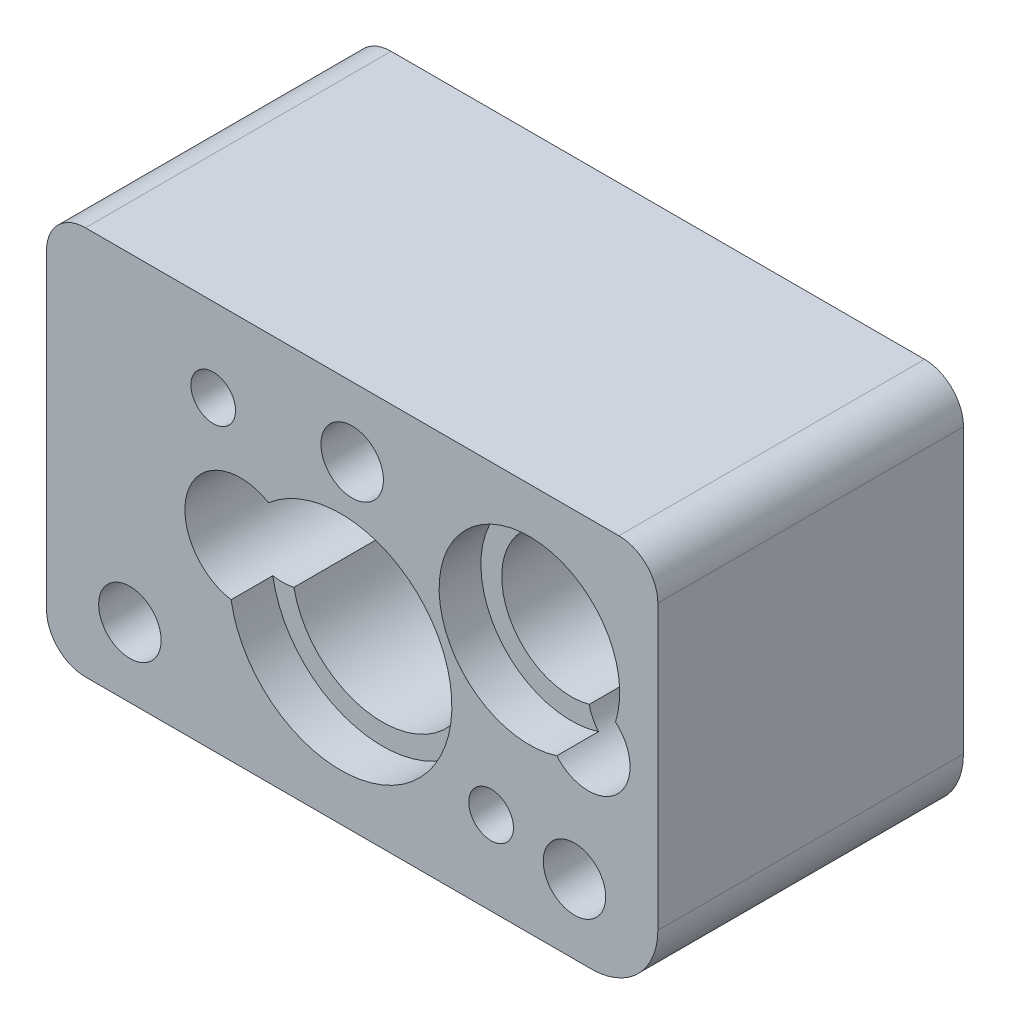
ISO-10303-21;
HEADER;
FILE_DESCRIPTION(('STEP AP214'),'2;1');
FILE_NAME('part.step','',(''),(''),'','','');
FILE_SCHEMA(('AUTOMOTIVE_DESIGN { 1 0 10303 214 1 1 1 1 }'));
ENDSEC;
DATA;
#1=APPLICATION_CONTEXT('core data for automotive mechanical design processes');
#2=APPLICATION_PROTOCOL_DEFINITION('international standard','automotive_design',2000,#1);
#3=PRODUCT_CONTEXT('',#1,'mechanical');
#4=PRODUCT('Part','Part','',(#3));
#5=PRODUCT_RELATED_PRODUCT_CATEGORY('part','',(#4));
#6=PRODUCT_DEFINITION_FORMATION('','',#4);
#7=PRODUCT_DEFINITION_CONTEXT('part definition',#1,'design');
#8=PRODUCT_DEFINITION('design','',#6,#7);
#9=PRODUCT_DEFINITION_SHAPE('','',#8);
#10=(LENGTH_UNIT() NAMED_UNIT(*) SI_UNIT(.MILLI.,.METRE.));
#11=(NAMED_UNIT(*) PLANE_ANGLE_UNIT() SI_UNIT($,.RADIAN.));
#12=(NAMED_UNIT(*) SI_UNIT($,.STERADIAN.) SOLID_ANGLE_UNIT());
#13=UNCERTAINTY_MEASURE_WITH_UNIT(LENGTH_MEASURE(1.E-05),#10,'distance_accuracy_value','');
#14=(GEOMETRIC_REPRESENTATION_CONTEXT(3) GLOBAL_UNCERTAINTY_ASSIGNED_CONTEXT((#13)) GLOBAL_UNIT_ASSIGNED_CONTEXT((#10,
#11,#12)) REPRESENTATION_CONTEXT('',''));
#15=CARTESIAN_POINT('',(0.,0.,0.));
#16=DIRECTION('',(0.,0.,1.));
#17=DIRECTION('',(1.,0.,0.));
#18=AXIS2_PLACEMENT_3D('',#15,#16,#17);
#19=CARTESIAN_POINT('',(-840.26329577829,-45.5554062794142,71.9581999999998));
#20=DIRECTION('',(0.,0.,-1.));
#21=DIRECTION('',(-1.,0.,0.));
#22=AXIS2_PLACEMENT_3D('',#19,#20,#21);
#23=PLANE('',#22);
#24=CARTESIAN_POINT('',(-851.69329577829,-43.6504062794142,71.9581999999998));
#25=DIRECTION('',(0.,0.,1.));
#26=DIRECTION('',(1.,0.,0.));
#27=AXIS2_PLACEMENT_3D('',#24,#25,#26);
#28=CIRCLE('',#27,2.55269999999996);
#29=CARTESIAN_POINT('',(-849.14059577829,-43.6504062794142,71.9581999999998));
#30=VERTEX_POINT('',#29);
#31=EDGE_CURVE('E349',#30,#30,#28,.T.);
#32=ORIENTED_EDGE('',*,*,#31,.F.);
#33=EDGE_LOOP('',(#32));
#34=FACE_BOUND('',#33,.T.);
#35=CARTESIAN_POINT('',(-842.16829577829,-45.2379062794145,71.9581999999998));
#36=DIRECTION('',(0.,0.,-1.));
#37=DIRECTION('',(-1.,0.,0.));
#38=AXIS2_PLACEMENT_3D('',#35,#36,#37);
#39=CIRCLE('',#38,3.56869999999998);
#40=CARTESIAN_POINT('',(-845.73699577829,-45.2379062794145,71.9581999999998));
#41=VERTEX_POINT('',#40);
#42=EDGE_CURVE('E335',#41,#41,#39,.T.);
#43=ORIENTED_EDGE('',*,*,#42,.T.);
#44=EDGE_LOOP('',(#43));
#45=FACE_BOUND('',#44,.T.);
#46=CARTESIAN_POINT('',(-892.96829577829,-45.2379062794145,71.9581999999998));
#47=DIRECTION('',(0.,0.,-1.));
#48=DIRECTION('',(-1.,0.,0.));
#49=AXIS2_PLACEMENT_3D('',#46,#47,#48);
#50=CIRCLE('',#49,3.56869999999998);
#51=CARTESIAN_POINT('',(-896.53699577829,-45.2379062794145,71.9581999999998));
#52=VERTEX_POINT('',#51);
#53=EDGE_CURVE('E312',#52,#52,#50,.T.);
#54=ORIENTED_EDGE('',*,*,#53,.T.);
#55=EDGE_LOOP('',(#54));
#56=FACE_BOUND('',#55,.T.);
#57=CARTESIAN_POINT('',(-867.56829577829,-16.6629062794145,71.9581999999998));
#58=DIRECTION('',(0.,0.,-1.));
#59=DIRECTION('',(-1.,0.,0.));
#60=AXIS2_PLACEMENT_3D('',#57,#58,#59);
#61=CIRCLE('',#60,3.56869999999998);
#62=CARTESIAN_POINT('',(-871.13699577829,-16.6629062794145,71.9581999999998));
#63=VERTEX_POINT('',#62);
#64=EDGE_CURVE('E278',#63,#63,#61,.T.);
#65=ORIENTED_EDGE('',*,*,#64,.T.);
#66=EDGE_LOOP('',(#65));
#67=FACE_BOUND('',#66,.T.);
#68=CARTESIAN_POINT('',(-840.26329577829,-45.5554062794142,71.9581999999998));
#69=DIRECTION('',(0.,0.,-1.));
#70=DIRECTION('',(-1.,0.,0.));
#71=AXIS2_PLACEMENT_3D('',#68,#69,#70);
#72=CIRCLE('',#71,7.61999999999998);
#73=CARTESIAN_POINT('',(-832.64329577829,-45.5554062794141,71.9581999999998));
#74=VERTEX_POINT('',#73);
#75=CARTESIAN_POINT('',(-840.26329577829,-53.1754062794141,71.9581999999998));
#76=VERTEX_POINT('',#75);
#77=EDGE_CURVE('E188',#74,#76,#72,.T.);
#78=ORIENTED_EDGE('',*,*,#77,.F.);
#79=DIRECTION('',(0.,-1.,0.));
#80=VECTOR('',#79,1.);
#81=CARTESIAN_POINT('',(-832.64329577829,-13.1704062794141,71.9581999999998));
#82=LINE('',#81,#80);
#83=CARTESIAN_POINT('',(-832.64329577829,-13.1704062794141,71.9581999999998));
#84=VERTEX_POINT('',#83);
#85=EDGE_CURVE('E393',#84,#74,#82,.T.);
#86=ORIENTED_EDGE('',*,*,#85,.F.);
#87=CARTESIAN_POINT('',(-837.08829577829,-13.1704062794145,71.9581999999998));
#88=DIRECTION('',(0.,0.,-1.));
#89=DIRECTION('',(-1.,0.,0.));
#90=AXIS2_PLACEMENT_3D('',#87,#88,#89);
#91=CIRCLE('',#90,4.44500000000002);
#92=CARTESIAN_POINT('',(-837.08829577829,-8.7254062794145,71.9581999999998));
#93=VERTEX_POINT('',#92);
#94=EDGE_CURVE('E387',#93,#84,#91,.T.);
#95=ORIENTED_EDGE('',*,*,#94,.F.);
#96=DIRECTION('',(1.,0.,0.));
#97=VECTOR('',#96,1.);
#98=CARTESIAN_POINT('',(-837.08829577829,-8.72540627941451,71.9581999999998));
#99=LINE('',#98,#97);
#100=CARTESIAN_POINT('',(-898.04829577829,-8.72540627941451,71.9581999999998));
#101=VERTEX_POINT('',#100);
#102=EDGE_CURVE('E394',#101,#93,#99,.T.);
#103=ORIENTED_EDGE('',*,*,#102,.F.);
#104=CARTESIAN_POINT('',(-898.04829577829,-13.1704062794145,71.9581999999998));
#105=DIRECTION('',(0.,0.,-1.));
#106=DIRECTION('',(1.,0.,0.));
#107=AXIS2_PLACEMENT_3D('',#104,#105,#106);
#108=CIRCLE('',#107,4.44500000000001);
#109=CARTESIAN_POINT('',(-902.49329577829,-13.1704062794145,71.9581999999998));
#110=VERTEX_POINT('',#109);
#111=EDGE_CURVE('E862',#110,#101,#108,.T.);
#112=ORIENTED_EDGE('',*,*,#111,.F.);
#113=DIRECTION('',(0.,1.,0.));
#114=VECTOR('',#113,1.);
#115=CARTESIAN_POINT('',(-902.49329577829,-13.1704062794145,71.9581999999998));
#116=LINE('',#115,#114);
#117=CARTESIAN_POINT('',(-902.49329577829,-48.7304062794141,71.9581999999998));
#118=VERTEX_POINT('',#117);
#119=EDGE_CURVE('E844',#118,#110,#116,.T.);
#120=ORIENTED_EDGE('',*,*,#119,.F.);
#121=CARTESIAN_POINT('',(-898.04829577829,-48.7304062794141,71.9581999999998));
#122=DIRECTION('',(0.,0.,-1.));
#123=DIRECTION('',(-1.,0.,0.));
#124=AXIS2_PLACEMENT_3D('',#121,#122,#123);
#125=CIRCLE('',#124,4.44500000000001);
#126=CARTESIAN_POINT('',(-898.04829577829,-53.1754062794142,71.9581999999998));
#127=VERTEX_POINT('',#126);
#128=EDGE_CURVE('E839',#127,#118,#125,.T.);
#129=ORIENTED_EDGE('',*,*,#128,.F.);
#130=DIRECTION('',(-1.,0.,0.));
#131=VECTOR('',#130,1.);
#132=CARTESIAN_POINT('',(-840.26329577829,-53.1754062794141,71.9581999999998));
#133=LINE('',#132,#131);
#134=EDGE_CURVE('E195',#76,#127,#133,.T.);
#135=ORIENTED_EDGE('',*,*,#134,.F.);
#136=EDGE_LOOP('',(#78,#86,#95,#103,#112,#120,#129,#135));
#137=FACE_BOUND('',#136,.T.);
#138=CARTESIAN_POINT('',(-840.580795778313,-30.9504062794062,71.9581999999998));
#139=DIRECTION('',(0.,0.,1.));
#140=DIRECTION('',(1.,0.,0.));
#141=AXIS2_PLACEMENT_3D('',#138,#139,#140);
#142=CIRCLE('',#141,4.7625);
#143=CARTESIAN_POINT('',(-844.195798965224,-34.0509156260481,71.9581999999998));
#144=VERTEX_POINT('',#143);
#145=CARTESIAN_POINT('',(-837.48028643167,-27.3354030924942,71.9581999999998));
#146=VERTEX_POINT('',#145);
#147=EDGE_CURVE('E198',#144,#146,#142,.T.);
#148=ORIENTED_EDGE('',*,*,#147,.F.);
#149=CARTESIAN_POINT('',(-847.315987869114,-24.2152141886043,71.9581999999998));
#150=DIRECTION('',(0.,0.,1.));
#151=DIRECTION('',(1.,0.,0.));
#152=AXIS2_PLACEMENT_3D('',#149,#150,#151);
#153=CIRCLE('',#152,10.31875);
#154=EDGE_CURVE('E481',#146,#144,#153,.T.);
#155=ORIENTED_EDGE('',*,*,#154,.F.);
#156=EDGE_LOOP('',(#148,#155));
#157=FACE_BOUND('',#156,.T.);
#158=CARTESIAN_POINT('',(-868.875063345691,-35.1203158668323,71.9581999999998));
#159=DIRECTION('',(0.,0.,1.));
#160=DIRECTION('',(1.,0.,0.));
#161=AXIS2_PLACEMENT_3D('',#158,#159,#160);
#162=CIRCLE('',#161,12.7);
#163=CARTESIAN_POINT('',(-881.402035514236,-37.2095665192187,71.9581999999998));
#164=VERTEX_POINT('',#163);
#165=CARTESIAN_POINT('',(-877.128336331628,-25.4676745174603,71.9581999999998));
#166=VERTEX_POINT('',#165);
#167=EDGE_CURVE('E167',#164,#166,#162,.T.);
#168=ORIENTED_EDGE('',*,*,#167,.F.);
#169=CARTESIAN_POINT('',(-880.331795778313,-30.9504062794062,71.9581999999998));
#170=DIRECTION('',(0.,0.,1.));
#171=DIRECTION('',(1.,0.,0.));
#172=AXIS2_PLACEMENT_3D('',#169,#170,#171);
#173=CIRCLE('',#172,6.34999999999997);
#174=EDGE_CURVE('E183',#166,#164,#173,.T.);
#175=ORIENTED_EDGE('',*,*,#174,.F.);
#176=EDGE_LOOP('',(#168,#175));
#177=FACE_BOUND('',#176,.T.);
#178=CARTESIAN_POINT('',(-883.44329577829,-18.2504062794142,71.9581999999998));
#179=DIRECTION('',(0.,0.,1.));
#180=DIRECTION('',(1.,0.,0.));
#181=AXIS2_PLACEMENT_3D('',#178,#179,#180);
#182=CIRCLE('',#181,2.55269999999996);
#183=CARTESIAN_POINT('',(-880.89059577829,-18.2504062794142,71.9581999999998));
#184=VERTEX_POINT('',#183);
#185=EDGE_CURVE('E348',#184,#184,#182,.T.);
#186=ORIENTED_EDGE('',*,*,#185,.F.);
#187=EDGE_LOOP('',(#186));
#188=FACE_BOUND('',#187,.T.);
#189=ADVANCED_FACE('F54',(#34,#45,#56,#67,#137,#157,#177,#188),#23,.F.);
#190=CARTESIAN_POINT('',(-840.26329577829,-45.5554062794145,37.0331999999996));
#191=DIRECTION('',(0.,0.,-1.));
#192=DIRECTION('',(-1.,0.,0.));
#193=AXIS2_PLACEMENT_3D('',#190,#191,#192);
#194=PLANE('',#193);
#195=CARTESIAN_POINT('',(-851.69329577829,-43.6504062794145,37.0331999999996));
#196=DIRECTION('',(0.,0.,1.));
#197=DIRECTION('',(1.,0.,0.));
#198=AXIS2_PLACEMENT_3D('',#195,#196,#197);
#199=CIRCLE('',#198,2.55269999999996);
#200=CARTESIAN_POINT('',(-849.14059577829,-43.6504062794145,37.0331999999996));
#201=VERTEX_POINT('',#200);
#202=EDGE_CURVE('E772',#201,#201,#199,.T.);
#203=ORIENTED_EDGE('',*,*,#202,.T.);
#204=EDGE_LOOP('',(#203));
#205=FACE_BOUND('',#204,.T.);
#206=CARTESIAN_POINT('',(-883.44329577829,-18.2504062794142,37.0331999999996));
#207=DIRECTION('',(0.,0.,1.));
#208=DIRECTION('',(1.,0.,0.));
#209=AXIS2_PLACEMENT_3D('',#206,#207,#208);
#210=CIRCLE('',#209,2.55269999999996);
#211=CARTESIAN_POINT('',(-880.89059577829,-18.2504062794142,37.0331999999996));
#212=VERTEX_POINT('',#211);
#213=EDGE_CURVE('E343',#212,#212,#210,.T.);
#214=ORIENTED_EDGE('',*,*,#213,.T.);
#215=EDGE_LOOP('',(#214));
#216=FACE_BOUND('',#215,.T.);
#217=CARTESIAN_POINT('',(-842.16829577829,-45.2379062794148,37.0331999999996));
#218=DIRECTION('',(0.,0.,-1.));
#219=DIRECTION('',(-1.,0.,0.));
#220=AXIS2_PLACEMENT_3D('',#217,#218,#219);
#221=CIRCLE('',#220,5.35940000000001);
#222=CARTESIAN_POINT('',(-847.52769577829,-45.2379062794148,37.0331999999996));
#223=VERTEX_POINT('',#222);
#224=EDGE_CURVE('E317',#223,#223,#221,.T.);
#225=ORIENTED_EDGE('',*,*,#224,.F.);
#226=EDGE_LOOP('',(#225));
#227=FACE_BOUND('',#226,.T.);
#228=CARTESIAN_POINT('',(-892.96829577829,-45.2379062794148,37.0331999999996));
#229=DIRECTION('',(0.,0.,-1.));
#230=DIRECTION('',(-1.,0.,0.));
#231=AXIS2_PLACEMENT_3D('',#228,#229,#230);
#232=CIRCLE('',#231,5.35940000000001);
#233=CARTESIAN_POINT('',(-898.32769577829,-45.2379062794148,37.0331999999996));
#234=VERTEX_POINT('',#233);
#235=EDGE_CURVE('E285',#234,#234,#232,.T.);
#236=ORIENTED_EDGE('',*,*,#235,.F.);
#237=EDGE_LOOP('',(#236));
#238=FACE_BOUND('',#237,.T.);
#239=CARTESIAN_POINT('',(-867.56829577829,-16.6629062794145,37.0331999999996));
#240=DIRECTION('',(0.,0.,-1.));
#241=DIRECTION('',(-1.,0.,0.));
#242=AXIS2_PLACEMENT_3D('',#239,#240,#241);
#243=CIRCLE('',#242,5.35940000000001);
#244=CARTESIAN_POINT('',(-872.92769577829,-16.6629062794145,37.0331999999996));
#245=VERTEX_POINT('',#244);
#246=EDGE_CURVE('E263',#245,#245,#243,.T.);
#247=ORIENTED_EDGE('',*,*,#246,.F.);
#248=EDGE_LOOP('',(#247));
#249=FACE_BOUND('',#248,.T.);
#250=CARTESIAN_POINT('',(-847.315987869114,-24.2152141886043,37.0331999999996));
#251=DIRECTION('',(0.,0.,1.));
#252=DIRECTION('',(1.,0.,0.));
#253=AXIS2_PLACEMENT_3D('',#250,#251,#252);
#254=CIRCLE('',#253,7.93750000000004);
#255=CARTESIAN_POINT('',(-839.651595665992,-26.2794327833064,37.0331999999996));
#256=VERTEX_POINT('',#255);
#257=CARTESIAN_POINT('',(-845.251769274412,-31.8796063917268,37.0331999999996));
#258=VERTEX_POINT('',#257);
#259=EDGE_CURVE('E79',#256,#258,#254,.T.);
#260=ORIENTED_EDGE('',*,*,#259,.T.);
#261=CARTESIAN_POINT('',(-840.580795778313,-30.9504062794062,37.0331999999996));
#262=DIRECTION('',(0.,0.,1.));
#263=DIRECTION('',(1.,0.,0.));
#264=AXIS2_PLACEMENT_3D('',#261,#262,#263);
#265=CIRCLE('',#264,4.7625);
#266=EDGE_CURVE('E492',#258,#256,#265,.T.);
#267=ORIENTED_EDGE('',*,*,#266,.T.);
#268=EDGE_LOOP('',(#260,#267));
#269=FACE_BOUND('',#268,.T.);
#270=CARTESIAN_POINT('',(-840.26329577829,-45.5554062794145,37.0331999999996));
#271=DIRECTION('',(0.,0.,-1.));
#272=DIRECTION('',(-1.,0.,0.));
#273=AXIS2_PLACEMENT_3D('',#270,#271,#272);
#274=CIRCLE('',#273,7.61999999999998);
#275=CARTESIAN_POINT('',(-832.64329577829,-45.5554062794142,37.0331999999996));
#276=VERTEX_POINT('',#275);
#277=CARTESIAN_POINT('',(-840.26329577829,-53.1754062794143,37.0332));
#278=VERTEX_POINT('',#277);
#279=EDGE_CURVE('E398',#276,#278,#274,.T.);
#280=ORIENTED_EDGE('',*,*,#279,.T.);
#281=DIRECTION('',(-1.,0.,0.));
#282=VECTOR('',#281,1.);
#283=CARTESIAN_POINT('',(-840.26329577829,-53.1754062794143,37.0332));
#284=LINE('',#283,#282);
#285=CARTESIAN_POINT('',(-898.04829577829,-53.1754062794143,37.0332));
#286=VERTEX_POINT('',#285);
#287=EDGE_CURVE('E402',#278,#286,#284,.T.);
#288=ORIENTED_EDGE('',*,*,#287,.T.);
#289=CARTESIAN_POINT('',(-898.04829577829,-48.7304062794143,37.0331999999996));
#290=DIRECTION('',(0.,0.,-1.));
#291=DIRECTION('',(-1.,0.,0.));
#292=AXIS2_PLACEMENT_3D('',#289,#290,#291);
#293=CIRCLE('',#292,4.44500000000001);
#294=CARTESIAN_POINT('',(-902.49329577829,-48.7304062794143,37.0331999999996));
#295=VERTEX_POINT('',#294);
#296=EDGE_CURVE('E405',#286,#295,#293,.T.);
#297=ORIENTED_EDGE('',*,*,#296,.T.);
#298=DIRECTION('',(0.,1.,0.));
#299=VECTOR('',#298,1.);
#300=CARTESIAN_POINT('',(-902.49329577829,-13.1704062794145,37.0331999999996));
#301=LINE('',#300,#299);
#302=CARTESIAN_POINT('',(-902.49329577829,-13.1704062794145,37.0331999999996));
#303=VERTEX_POINT('',#302);
#304=EDGE_CURVE('E408',#295,#303,#301,.T.);
#305=ORIENTED_EDGE('',*,*,#304,.T.);
#306=CARTESIAN_POINT('',(-898.04829577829,-13.1704062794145,37.0331999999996));
#307=DIRECTION('',(0.,0.,-1.));
#308=DIRECTION('',(1.,0.,0.));
#309=AXIS2_PLACEMENT_3D('',#306,#307,#308);
#310=CIRCLE('',#309,4.44500000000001);
#311=CARTESIAN_POINT('',(-898.04829577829,-8.72540627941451,37.0331999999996));
#312=VERTEX_POINT('',#311);
#313=EDGE_CURVE('E411',#303,#312,#310,.T.);
#314=ORIENTED_EDGE('',*,*,#313,.T.);
#315=DIRECTION('',(1.,0.,0.));
#316=VECTOR('',#315,1.);
#317=CARTESIAN_POINT('',(-837.08829577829,-8.72540627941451,37.0331999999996));
#318=LINE('',#317,#316);
#319=CARTESIAN_POINT('',(-837.08829577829,-8.7254062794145,37.0331999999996));
#320=VERTEX_POINT('',#319);
#321=EDGE_CURVE('E414',#312,#320,#318,.T.);
#322=ORIENTED_EDGE('',*,*,#321,.T.);
#323=CARTESIAN_POINT('',(-837.08829577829,-13.1704062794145,37.0331999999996));
#324=DIRECTION('',(0.,0.,-1.));
#325=DIRECTION('',(-1.,0.,0.));
#326=AXIS2_PLACEMENT_3D('',#323,#324,#325);
#327=CIRCLE('',#326,4.44500000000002);
#328=CARTESIAN_POINT('',(-832.64329577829,-13.1704062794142,37.0331999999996));
#329=VERTEX_POINT('',#328);
#330=EDGE_CURVE('E416',#320,#329,#327,.T.);
#331=ORIENTED_EDGE('',*,*,#330,.T.);
#332=DIRECTION('',(0.,-1.,0.));
#333=VECTOR('',#332,1.);
#334=CARTESIAN_POINT('',(-832.64329577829,-13.1704062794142,37.0331999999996));
#335=LINE('',#334,#333);
#336=EDGE_CURVE('E370',#329,#276,#335,.T.);
#337=ORIENTED_EDGE('',*,*,#336,.T.);
#338=EDGE_LOOP('',(#280,#288,#297,#305,#314,#322,#331,#337));
#339=FACE_BOUND('',#338,.T.);
#340=CARTESIAN_POINT('',(-880.331795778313,-30.9504062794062,37.0331999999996));
#341=DIRECTION('',(0.,0.,1.));
#342=DIRECTION('',(1.,0.,0.));
#343=AXIS2_PLACEMENT_3D('',#340,#341,#342);
#344=CIRCLE('',#343,6.34999999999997);
#345=CARTESIAN_POINT('',(-875.31487430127,-27.0577209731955,37.0331999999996));
#346=VERTEX_POINT('',#345);
#347=CARTESIAN_POINT('',(-878.990780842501,-37.157191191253,37.0331999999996));
#348=VERTEX_POINT('',#347);
#349=EDGE_CURVE('E189',#346,#348,#344,.T.);
#350=ORIENTED_EDGE('',*,*,#349,.T.);
#351=CARTESIAN_POINT('',(-868.875063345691,-35.1203158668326,37.0331999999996));
#352=DIRECTION('',(0.,0.,1.));
#353=DIRECTION('',(1.,0.,0.));
#354=AXIS2_PLACEMENT_3D('',#351,#352,#353);
#355=CIRCLE('',#354,10.31875);
#356=EDGE_CURVE('E240',#348,#346,#355,.T.);
#357=ORIENTED_EDGE('',*,*,#356,.T.);
#358=EDGE_LOOP('',(#350,#357));
#359=FACE_BOUND('',#358,.T.);
#360=ADVANCED_FACE('F239',(#205,#216,#227,#238,#249,#269,#339,#359),#194,.T.);
#361=CARTESIAN_POINT('',(-840.26329577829,-45.5554062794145,37.0331999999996));
#362=DIRECTION('',(0.,0.,1.));
#363=DIRECTION('',(1.,0.,0.));
#364=AXIS2_PLACEMENT_3D('',#361,#362,#363);
#365=CYLINDRICAL_SURFACE('',#364,7.61999999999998);
#366=DIRECTION('',(0.,0.,1.));
#367=VECTOR('',#366,1.);
#368=CARTESIAN_POINT('',(-832.64329577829,-45.5554062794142,37.0331999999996));
#369=LINE('',#368,#367);
#370=EDGE_CURVE('E364',#276,#74,#369,.T.);
#371=ORIENTED_EDGE('',*,*,#370,.T.);
#372=ORIENTED_EDGE('',*,*,#77,.T.);
#373=DIRECTION('',(0.,0.,1.));
#374=VECTOR('',#373,1.);
#375=CARTESIAN_POINT('',(-840.26329577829,-53.1754062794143,37.0332));
#376=LINE('',#375,#374);
#377=EDGE_CURVE('E433',#278,#76,#376,.T.);
#378=ORIENTED_EDGE('',*,*,#377,.F.);
#379=ORIENTED_EDGE('',*,*,#279,.F.);
#380=EDGE_LOOP('',(#371,#372,#378,#379));
#381=FACE_BOUND('',#380,.T.);
#382=ADVANCED_FACE('F56',(#381),#365,.T.);
#383=CARTESIAN_POINT('',(-840.26329577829,-53.1754062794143,37.0332));
#384=DIRECTION('',(0.,1.,0.));
#385=DIRECTION('',(-1.,0.,0.));
#386=AXIS2_PLACEMENT_3D('',#383,#384,#385);
#387=PLANE('',#386);
#388=ORIENTED_EDGE('',*,*,#377,.T.);
#389=ORIENTED_EDGE('',*,*,#134,.T.);
#390=DIRECTION('',(0.,0.,1.));
#391=VECTOR('',#390,1.);
#392=CARTESIAN_POINT('',(-898.04829577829,-53.1754062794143,37.0332));
#393=LINE('',#392,#391);
#394=EDGE_CURVE('E439',#286,#127,#393,.T.);
#395=ORIENTED_EDGE('',*,*,#394,.F.);
#396=ORIENTED_EDGE('',*,*,#287,.F.);
#397=EDGE_LOOP('',(#388,#389,#395,#396));
#398=FACE_BOUND('',#397,.T.);
#399=ADVANCED_FACE('F555',(#398),#387,.F.);
#400=CARTESIAN_POINT('',(-898.04829577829,-48.7304062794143,37.0331999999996));
#401=DIRECTION('',(0.,0.,1.));
#402=DIRECTION('',(1.,0.,0.));
#403=AXIS2_PLACEMENT_3D('',#400,#401,#402);
#404=CYLINDRICAL_SURFACE('',#403,4.44500000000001);
#405=ORIENTED_EDGE('',*,*,#394,.T.);
#406=ORIENTED_EDGE('',*,*,#128,.T.);
#407=DIRECTION('',(0.,0.,1.));
#408=VECTOR('',#407,1.);
#409=CARTESIAN_POINT('',(-902.49329577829,-48.7304062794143,37.0331999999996));
#410=LINE('',#409,#408);
#411=EDGE_CURVE('E446',#295,#118,#410,.T.);
#412=ORIENTED_EDGE('',*,*,#411,.F.);
#413=ORIENTED_EDGE('',*,*,#296,.F.);
#414=EDGE_LOOP('',(#405,#406,#412,#413));
#415=FACE_BOUND('',#414,.T.);
#416=ADVANCED_FACE('F552',(#415),#404,.T.);
#417=CARTESIAN_POINT('',(-902.49329577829,-13.1704062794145,37.0331999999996));
#418=DIRECTION('',(1.,0.,0.));
#419=DIRECTION('',(0.,0.,-1.));
#420=AXIS2_PLACEMENT_3D('',#417,#418,#419);
#421=PLANE('',#420);
#422=ORIENTED_EDGE('',*,*,#411,.T.);
#423=ORIENTED_EDGE('',*,*,#119,.T.);
#424=DIRECTION('',(0.,0.,1.));
#425=VECTOR('',#424,1.);
#426=CARTESIAN_POINT('',(-902.49329577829,-13.1704062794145,37.0331999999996));
#427=LINE('',#426,#425);
#428=EDGE_CURVE('E849',#303,#110,#427,.T.);
#429=ORIENTED_EDGE('',*,*,#428,.F.);
#430=ORIENTED_EDGE('',*,*,#304,.F.);
#431=EDGE_LOOP('',(#422,#423,#429,#430));
#432=FACE_BOUND('',#431,.T.);
#433=ADVANCED_FACE('F548',(#432),#421,.F.);
#434=CARTESIAN_POINT('',(-898.04829577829,-13.1704062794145,37.0331999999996));
#435=DIRECTION('',(0.,0.,1.));
#436=DIRECTION('',(1.,0.,0.));
#437=AXIS2_PLACEMENT_3D('',#434,#435,#436);
#438=CYLINDRICAL_SURFACE('',#437,4.44500000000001);
#439=ORIENTED_EDGE('',*,*,#428,.T.);
#440=ORIENTED_EDGE('',*,*,#111,.T.);
#441=DIRECTION('',(0.,0.,1.));
#442=VECTOR('',#441,1.);
#443=CARTESIAN_POINT('',(-898.04829577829,-8.72540627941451,37.0331999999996));
#444=LINE('',#443,#442);
#445=EDGE_CURVE('E378',#312,#101,#444,.T.);
#446=ORIENTED_EDGE('',*,*,#445,.F.);
#447=ORIENTED_EDGE('',*,*,#313,.F.);
#448=EDGE_LOOP('',(#439,#440,#446,#447));
#449=FACE_BOUND('',#448,.T.);
#450=ADVANCED_FACE('F544',(#449),#438,.T.);
#451=CARTESIAN_POINT('',(-837.08829577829,-8.72540627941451,37.0331999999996));
#452=DIRECTION('',(0.,-1.,0.));
#453=DIRECTION('',(0.,0.,-1.));
#454=AXIS2_PLACEMENT_3D('',#451,#452,#453);
#455=PLANE('',#454);
#456=ORIENTED_EDGE('',*,*,#445,.T.);
#457=ORIENTED_EDGE('',*,*,#102,.T.);
#458=DIRECTION('',(0.,0.,1.));
#459=VECTOR('',#458,1.);
#460=CARTESIAN_POINT('',(-837.08829577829,-8.7254062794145,37.0331999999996));
#461=LINE('',#460,#459);
#462=EDGE_CURVE('E374',#320,#93,#461,.T.);
#463=ORIENTED_EDGE('',*,*,#462,.F.);
#464=ORIENTED_EDGE('',*,*,#321,.F.);
#465=EDGE_LOOP('',(#456,#457,#463,#464));
#466=FACE_BOUND('',#465,.T.);
#467=ADVANCED_FACE('F540',(#466),#455,.F.);
#468=CARTESIAN_POINT('',(-837.08829577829,-13.1704062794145,37.0331999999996));
#469=DIRECTION('',(0.,0.,1.));
#470=DIRECTION('',(1.,0.,0.));
#471=AXIS2_PLACEMENT_3D('',#468,#469,#470);
#472=CYLINDRICAL_SURFACE('',#471,4.44500000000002);
#473=ORIENTED_EDGE('',*,*,#462,.T.);
#474=ORIENTED_EDGE('',*,*,#94,.T.);
#475=DIRECTION('',(0.,0.,1.));
#476=VECTOR('',#475,1.);
#477=CARTESIAN_POINT('',(-832.64329577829,-13.1704062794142,37.0331999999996));
#478=LINE('',#477,#476);
#479=EDGE_CURVE('E369',#329,#84,#478,.T.);
#480=ORIENTED_EDGE('',*,*,#479,.F.);
#481=ORIENTED_EDGE('',*,*,#330,.F.);
#482=EDGE_LOOP('',(#473,#474,#480,#481));
#483=FACE_BOUND('',#482,.T.);
#484=ADVANCED_FACE('F537',(#483),#472,.T.);
#485=CARTESIAN_POINT('',(-832.64329577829,-13.1704062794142,37.0331999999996));
#486=DIRECTION('',(-1.,0.,0.));
#487=DIRECTION('',(0.,0.,1.));
#488=AXIS2_PLACEMENT_3D('',#485,#486,#487);
#489=PLANE('',#488);
#490=ORIENTED_EDGE('',*,*,#479,.T.);
#491=ORIENTED_EDGE('',*,*,#85,.T.);
#492=ORIENTED_EDGE('',*,*,#370,.F.);
#493=ORIENTED_EDGE('',*,*,#336,.F.);
#494=EDGE_LOOP('',(#490,#491,#492,#493));
#495=FACE_BOUND('',#494,.T.);
#496=ADVANCED_FACE('F429',(#495),#489,.F.);
#497=CARTESIAN_POINT('',(-880.331795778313,-30.9504062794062,71.9581999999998));
#498=DIRECTION('',(0.,0.,1.));
#499=DIRECTION('',(1.,0.,0.));
#500=AXIS2_PLACEMENT_3D('',#497,#498,#499);
#501=CYLINDRICAL_SURFACE('',#500,6.34999999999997);
#502=ORIENTED_EDGE('',*,*,#349,.F.);
#503=DIRECTION('',(0.,0.,1.));
#504=VECTOR('',#503,1.);
#505=CARTESIAN_POINT('',(-875.31487430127,-27.0577209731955,52.1144499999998));
#506=LINE('',#505,#504);
#507=CARTESIAN_POINT('',(-875.31487430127,-27.0577209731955,67.1956999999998));
#508=VERTEX_POINT('',#507);
#509=EDGE_CURVE('E12',#346,#508,#506,.T.);
#510=ORIENTED_EDGE('',*,*,#509,.T.);
#511=CARTESIAN_POINT('',(-880.331795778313,-30.9504062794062,67.1956999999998));
#512=DIRECTION('',(0.,0.,-1.));
#513=DIRECTION('',(-1.,0.,0.));
#514=AXIS2_PLACEMENT_3D('',#511,#512,#513);
#515=CIRCLE('',#514,6.34999999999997);
#516=CARTESIAN_POINT('',(-877.128336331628,-25.4676745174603,67.1956999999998));
#517=VERTEX_POINT('',#516);
#518=EDGE_CURVE('E64',#508,#517,#515,.F.);
#519=ORIENTED_EDGE('',*,*,#518,.T.);
#520=DIRECTION('',(0.,0.,1.));
#521=VECTOR('',#520,1.);
#522=CARTESIAN_POINT('',(-877.128336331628,-25.4676745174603,69.5769499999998));
#523=LINE('',#522,#521);
#524=EDGE_CURVE('E170',#517,#166,#523,.T.);
#525=ORIENTED_EDGE('',*,*,#524,.T.);
#526=ORIENTED_EDGE('',*,*,#174,.T.);
#527=DIRECTION('',(0.,0.,1.));
#528=VECTOR('',#527,1.);
#529=CARTESIAN_POINT('',(-881.402035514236,-37.2095665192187,69.5769499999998));
#530=LINE('',#529,#528);
#531=CARTESIAN_POINT('',(-881.402035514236,-37.2095665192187,67.1956999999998));
#532=VERTEX_POINT('',#531);
#533=EDGE_CURVE('E71',#164,#532,#530,.F.);
#534=ORIENTED_EDGE('',*,*,#533,.T.);
#535=CARTESIAN_POINT('',(-878.990780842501,-37.1571911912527,67.1956999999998));
#536=VERTEX_POINT('',#535);
#537=EDGE_CURVE('E176',#532,#536,#515,.F.);
#538=ORIENTED_EDGE('',*,*,#537,.T.);
#539=DIRECTION('',(0.,0.,1.));
#540=VECTOR('',#539,1.);
#541=CARTESIAN_POINT('',(-878.990780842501,-37.1571911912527,52.1144499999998));
#542=LINE('',#541,#540);
#543=EDGE_CURVE('E227',#536,#348,#542,.F.);
#544=ORIENTED_EDGE('',*,*,#543,.T.);
#545=EDGE_LOOP('',(#502,#510,#519,#525,#526,#534,#538,#544));
#546=FACE_BOUND('',#545,.T.);
#547=ADVANCED_FACE('F182',(#546),#501,.F.);
#548=CARTESIAN_POINT('',(-840.580795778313,-30.9504062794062,71.9581999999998));
#549=DIRECTION('',(0.,0.,1.));
#550=DIRECTION('',(1.,0.,0.));
#551=AXIS2_PLACEMENT_3D('',#548,#549,#550);
#552=CYLINDRICAL_SURFACE('',#551,4.7625);
#553=CARTESIAN_POINT('',(-840.580795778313,-30.9504062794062,67.1829999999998));
#554=DIRECTION('',(0.,0.,-1.));
#555=DIRECTION('',(-1.,0.,0.));
#556=AXIS2_PLACEMENT_3D('',#553,#554,#555);
#557=CIRCLE('',#556,4.7625);
#558=CARTESIAN_POINT('',(-845.251769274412,-31.8796063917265,67.1829999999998));
#559=VERTEX_POINT('',#558);
#560=CARTESIAN_POINT('',(-844.195798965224,-34.0509156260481,67.1829999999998));
#561=VERTEX_POINT('',#560);
#562=EDGE_CURVE('E221',#559,#561,#557,.F.);
#563=ORIENTED_EDGE('',*,*,#562,.T.);
#564=DIRECTION('',(0.,0.,1.));
#565=VECTOR('',#564,1.);
#566=CARTESIAN_POINT('',(-844.195798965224,-34.0509156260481,69.5705999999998));
#567=LINE('',#566,#565);
#568=EDGE_CURVE('E177',#561,#144,#567,.T.);
#569=ORIENTED_EDGE('',*,*,#568,.T.);
#570=ORIENTED_EDGE('',*,*,#147,.T.);
#571=DIRECTION('',(0.,0.,1.));
#572=VECTOR('',#571,1.);
#573=CARTESIAN_POINT('',(-837.48028643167,-27.3354030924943,69.5705999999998));
#574=LINE('',#573,#572);
#575=CARTESIAN_POINT('',(-837.48028643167,-27.3354030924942,67.1829999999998));
#576=VERTEX_POINT('',#575);
#577=EDGE_CURVE('E453',#146,#576,#574,.F.);
#578=ORIENTED_EDGE('',*,*,#577,.T.);
#579=CARTESIAN_POINT('',(-839.651595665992,-26.2794327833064,67.1829999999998));
#580=VERTEX_POINT('',#579);
#581=EDGE_CURVE('E444',#576,#580,#557,.F.);
#582=ORIENTED_EDGE('',*,*,#581,.T.);
#583=DIRECTION('',(0.,0.,1.));
#584=VECTOR('',#583,1.);
#585=CARTESIAN_POINT('',(-839.651595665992,-26.2794327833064,52.1080999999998));
#586=LINE('',#585,#584);
#587=EDGE_CURVE('E438',#580,#256,#586,.F.);
#588=ORIENTED_EDGE('',*,*,#587,.T.);
#589=ORIENTED_EDGE('',*,*,#266,.F.);
#590=DIRECTION('',(0.,0.,1.));
#591=VECTOR('',#590,1.);
#592=CARTESIAN_POINT('',(-845.251769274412,-31.8796063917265,52.1080999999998));
#593=LINE('',#592,#591);
#594=EDGE_CURVE('E222',#258,#559,#593,.T.);
#595=ORIENTED_EDGE('',*,*,#594,.T.);
#596=EDGE_LOOP('',(#563,#569,#570,#578,#582,#588,#589,#595));
#597=FACE_BOUND('',#596,.T.);
#598=ADVANCED_FACE('F466',(#597),#552,.F.);
#599=CARTESIAN_POINT('',(-839.378487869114,-24.215214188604,67.1829999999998));
#600=DIRECTION('',(0.,0.,-1.));
#601=DIRECTION('',(-1.,0.,0.));
#602=AXIS2_PLACEMENT_3D('',#599,#600,#601);
#603=PLANE('',#602);
#604=CARTESIAN_POINT('',(-847.315987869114,-24.2152141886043,67.1829999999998));
#605=DIRECTION('',(0.,0.,1.));
#606=DIRECTION('',(1.,0.,0.));
#607=AXIS2_PLACEMENT_3D('',#604,#605,#606);
#608=CIRCLE('',#607,7.93750000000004);
#609=EDGE_CURVE('E473',#580,#559,#608,.T.);
#610=ORIENTED_EDGE('',*,*,#609,.F.);
#611=ORIENTED_EDGE('',*,*,#581,.F.);
#612=CARTESIAN_POINT('',(-847.315987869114,-24.2152141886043,67.1829999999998));
#613=DIRECTION('',(0.,0.,1.));
#614=DIRECTION('',(1.,0.,0.));
#615=AXIS2_PLACEMENT_3D('',#612,#613,#614);
#616=CIRCLE('',#615,10.31875);
#617=EDGE_CURVE('E475',#576,#561,#616,.T.);
#618=ORIENTED_EDGE('',*,*,#617,.T.);
#619=ORIENTED_EDGE('',*,*,#562,.F.);
#620=EDGE_LOOP('',(#610,#611,#618,#619));
#621=FACE_BOUND('',#620,.T.);
#622=ADVANCED_FACE('F472',(#621),#603,.F.);
#623=CARTESIAN_POINT('',(-847.315987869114,-24.2152141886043,71.9581999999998));
#624=DIRECTION('',(0.,0.,1.));
#625=DIRECTION('',(1.,0.,0.));
#626=AXIS2_PLACEMENT_3D('',#623,#624,#625);
#627=CYLINDRICAL_SURFACE('',#626,10.31875);
#628=ORIENTED_EDGE('',*,*,#617,.F.);
#629=ORIENTED_EDGE('',*,*,#577,.F.);
#630=ORIENTED_EDGE('',*,*,#154,.T.);
#631=ORIENTED_EDGE('',*,*,#568,.F.);
#632=EDGE_LOOP('',(#628,#629,#630,#631));
#633=FACE_BOUND('',#632,.T.);
#634=ADVANCED_FACE('F508',(#633),#627,.F.);
#635=CARTESIAN_POINT('',(-847.315987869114,-24.2152141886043,71.9581999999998));
#636=DIRECTION('',(0.,0.,1.));
#637=DIRECTION('',(1.,0.,0.));
#638=AXIS2_PLACEMENT_3D('',#635,#636,#637);
#639=CYLINDRICAL_SURFACE('',#638,7.93750000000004);
#640=ORIENTED_EDGE('',*,*,#259,.F.);
#641=ORIENTED_EDGE('',*,*,#587,.F.);
#642=ORIENTED_EDGE('',*,*,#609,.T.);
#643=ORIENTED_EDGE('',*,*,#594,.F.);
#644=EDGE_LOOP('',(#640,#641,#642,#643));
#645=FACE_BOUND('',#644,.T.);
#646=ADVANCED_FACE('F476',(#645),#639,.F.);
#647=CARTESIAN_POINT('',(-858.556313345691,-35.1203158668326,67.1956999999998));
#648=DIRECTION('',(0.,0.,-1.));
#649=DIRECTION('',(-1.,0.,0.));
#650=AXIS2_PLACEMENT_3D('',#647,#648,#649);
#651=PLANE('',#650);
#652=CARTESIAN_POINT('',(-868.875063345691,-35.1203158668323,67.1956999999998));
#653=DIRECTION('',(0.,0.,1.));
#654=DIRECTION('',(1.,0.,0.));
#655=AXIS2_PLACEMENT_3D('',#652,#653,#654);
#656=CIRCLE('',#655,12.7);
#657=EDGE_CURVE('E248',#532,#517,#656,.T.);
#658=ORIENTED_EDGE('',*,*,#657,.T.);
#659=ORIENTED_EDGE('',*,*,#518,.F.);
#660=CARTESIAN_POINT('',(-868.875063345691,-35.1203158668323,67.1956999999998));
#661=DIRECTION('',(0.,0.,1.));
#662=DIRECTION('',(1.,0.,0.));
#663=AXIS2_PLACEMENT_3D('',#660,#661,#662);
#664=CIRCLE('',#663,10.31875);
#665=EDGE_CURVE('E242',#536,#508,#664,.T.);
#666=ORIENTED_EDGE('',*,*,#665,.F.);
#667=ORIENTED_EDGE('',*,*,#537,.F.);
#668=EDGE_LOOP('',(#658,#659,#666,#667));
#669=FACE_BOUND('',#668,.T.);
#670=ADVANCED_FACE('F516',(#669),#651,.F.);
#671=CARTESIAN_POINT('',(-868.875063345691,-35.1203158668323,71.9581999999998));
#672=DIRECTION('',(0.,0.,1.));
#673=DIRECTION('',(1.,0.,0.));
#674=AXIS2_PLACEMENT_3D('',#671,#672,#673);
#675=CYLINDRICAL_SURFACE('',#674,10.31875);
#676=ORIENTED_EDGE('',*,*,#356,.F.);
#677=ORIENTED_EDGE('',*,*,#543,.F.);
#678=ORIENTED_EDGE('',*,*,#665,.T.);
#679=ORIENTED_EDGE('',*,*,#509,.F.);
#680=EDGE_LOOP('',(#676,#677,#678,#679));
#681=FACE_BOUND('',#680,.T.);
#682=ADVANCED_FACE('F625',(#681),#675,.F.);
#683=CARTESIAN_POINT('',(-868.875063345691,-35.1203158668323,71.9581999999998));
#684=DIRECTION('',(0.,0.,1.));
#685=DIRECTION('',(1.,0.,0.));
#686=AXIS2_PLACEMENT_3D('',#683,#684,#685);
#687=CYLINDRICAL_SURFACE('',#686,12.7);
#688=ORIENTED_EDGE('',*,*,#657,.F.);
#689=ORIENTED_EDGE('',*,*,#533,.F.);
#690=ORIENTED_EDGE('',*,*,#167,.T.);
#691=ORIENTED_EDGE('',*,*,#524,.F.);
#692=EDGE_LOOP('',(#688,#689,#690,#691));
#693=FACE_BOUND('',#692,.T.);
#694=ADVANCED_FACE('F169',(#693),#687,.F.);
#695=CARTESIAN_POINT('',(-867.56829577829,-16.6629062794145,37.0331999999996));
#696=DIRECTION('',(0.,0.,-1.));
#697=DIRECTION('',(-1.,0.,0.));
#698=AXIS2_PLACEMENT_3D('',#695,#696,#697);
#699=CYLINDRICAL_SURFACE('',#698,5.35940000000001);
#700=CARTESIAN_POINT('',(-867.56829577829,-16.6629062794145,51.2571999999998));
#701=DIRECTION('',(0.,0.,-1.));
#702=DIRECTION('',(-1.,0.,0.));
#703=AXIS2_PLACEMENT_3D('',#700,#701,#702);
#704=CIRCLE('',#703,5.35940000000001);
#705=CARTESIAN_POINT('',(-872.92769577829,-16.6629062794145,51.2571999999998));
#706=VERTEX_POINT('',#705);
#707=EDGE_CURVE('E793',#706,#706,#704,.T.);
#708=ORIENTED_EDGE('',*,*,#707,.F.);
#709=EDGE_LOOP('',(#708));
#710=FACE_BOUND('',#709,.T.);
#711=ORIENTED_EDGE('',*,*,#246,.T.);
#712=EDGE_LOOP('',(#711));
#713=FACE_BOUND('',#712,.T.);
#714=ADVANCED_FACE('F641',(#710,#713),#699,.F.);
#715=CARTESIAN_POINT('',(-863.99959577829,-16.6629062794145,51.2571999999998));
#716=DIRECTION('',(0.,0.,1.));
#717=DIRECTION('',(1.,0.,0.));
#718=AXIS2_PLACEMENT_3D('',#715,#716,#717);
#719=PLANE('',#718);
#720=CARTESIAN_POINT('',(-867.56829577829,-16.6629062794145,51.2571999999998));
#721=DIRECTION('',(0.,0.,-1.));
#722=DIRECTION('',(-1.,0.,0.));
#723=AXIS2_PLACEMENT_3D('',#720,#721,#722);
#724=CIRCLE('',#723,3.56869999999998);
#725=CARTESIAN_POINT('',(-871.13699577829,-16.6629062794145,51.2571999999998));
#726=VERTEX_POINT('',#725);
#727=EDGE_CURVE('E284',#726,#726,#724,.T.);
#728=ORIENTED_EDGE('',*,*,#727,.F.);
#729=EDGE_LOOP('',(#728));
#730=FACE_BOUND('',#729,.T.);
#731=ORIENTED_EDGE('',*,*,#707,.T.);
#732=EDGE_LOOP('',(#731));
#733=FACE_BOUND('',#732,.T.);
#734=ADVANCED_FACE('F649',(#730,#733),#719,.F.);
#735=CARTESIAN_POINT('',(-867.56829577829,-16.6629062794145,37.0331999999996));
#736=DIRECTION('',(0.,0.,-1.));
#737=DIRECTION('',(-1.,0.,0.));
#738=AXIS2_PLACEMENT_3D('',#735,#736,#737);
#739=CYLINDRICAL_SURFACE('',#738,3.56869999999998);
#740=ORIENTED_EDGE('',*,*,#64,.F.);
#741=EDGE_LOOP('',(#740));
#742=FACE_BOUND('',#741,.T.);
#743=ORIENTED_EDGE('',*,*,#727,.T.);
#744=EDGE_LOOP('',(#743));
#745=FACE_BOUND('',#744,.T.);
#746=ADVANCED_FACE('F658',(#742,#745),#739,.F.);
#747=CARTESIAN_POINT('',(-892.96829577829,-45.2379062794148,37.0331999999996));
#748=DIRECTION('',(0.,0.,-1.));
#749=DIRECTION('',(-1.,0.,0.));
#750=AXIS2_PLACEMENT_3D('',#747,#748,#749);
#751=CYLINDRICAL_SURFACE('',#750,5.35940000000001);
#752=CARTESIAN_POINT('',(-892.96829577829,-45.2379062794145,51.2571999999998));
#753=DIRECTION('',(0.,0.,-1.));
#754=DIRECTION('',(-1.,0.,0.));
#755=AXIS2_PLACEMENT_3D('',#752,#753,#754);
#756=CIRCLE('',#755,5.35940000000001);
#757=CARTESIAN_POINT('',(-898.32769577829,-45.2379062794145,51.2571999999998));
#758=VERTEX_POINT('',#757);
#759=EDGE_CURVE('E299',#758,#758,#756,.T.);
#760=ORIENTED_EDGE('',*,*,#759,.F.);
#761=EDGE_LOOP('',(#760));
#762=FACE_BOUND('',#761,.T.);
#763=ORIENTED_EDGE('',*,*,#235,.T.);
#764=EDGE_LOOP('',(#763));
#765=FACE_BOUND('',#764,.T.);
#766=ADVANCED_FACE('F667',(#762,#765),#751,.F.);
#767=CARTESIAN_POINT('',(-889.39959577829,-45.2379062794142,51.2571999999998));
#768=DIRECTION('',(0.,0.,1.));
#769=DIRECTION('',(1.,0.,0.));
#770=AXIS2_PLACEMENT_3D('',#767,#768,#769);
#771=PLANE('',#770);
#772=CARTESIAN_POINT('',(-892.96829577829,-45.2379062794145,51.2571999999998));
#773=DIRECTION('',(0.,0.,-1.));
#774=DIRECTION('',(-1.,0.,0.));
#775=AXIS2_PLACEMENT_3D('',#772,#773,#774);
#776=CIRCLE('',#775,3.56869999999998);
#777=CARTESIAN_POINT('',(-896.53699577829,-45.2379062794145,51.2571999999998));
#778=VERTEX_POINT('',#777);
#779=EDGE_CURVE('E304',#778,#778,#776,.T.);
#780=ORIENTED_EDGE('',*,*,#779,.F.);
#781=EDGE_LOOP('',(#780));
#782=FACE_BOUND('',#781,.T.);
#783=ORIENTED_EDGE('',*,*,#759,.T.);
#784=EDGE_LOOP('',(#783));
#785=FACE_BOUND('',#784,.T.);
#786=ADVANCED_FACE('F676',(#782,#785),#771,.F.);
#787=CARTESIAN_POINT('',(-892.96829577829,-45.2379062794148,37.0331999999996));
#788=DIRECTION('',(0.,0.,-1.));
#789=DIRECTION('',(-1.,0.,0.));
#790=AXIS2_PLACEMENT_3D('',#787,#788,#789);
#791=CYLINDRICAL_SURFACE('',#790,3.56869999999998);
#792=ORIENTED_EDGE('',*,*,#53,.F.);
#793=EDGE_LOOP('',(#792));
#794=FACE_BOUND('',#793,.T.);
#795=ORIENTED_EDGE('',*,*,#779,.T.);
#796=EDGE_LOOP('',(#795));
#797=FACE_BOUND('',#796,.T.);
#798=ADVANCED_FACE('F685',(#794,#797),#791,.F.);
#799=CARTESIAN_POINT('',(-842.16829577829,-45.2379062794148,37.0331999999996));
#800=DIRECTION('',(0.,0.,-1.));
#801=DIRECTION('',(-1.,0.,0.));
#802=AXIS2_PLACEMENT_3D('',#799,#800,#801);
#803=CYLINDRICAL_SURFACE('',#802,5.35940000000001);
#804=CARTESIAN_POINT('',(-842.16829577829,-45.2379062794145,51.2571999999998));
#805=DIRECTION('',(0.,0.,-1.));
#806=DIRECTION('',(-1.,0.,0.));
#807=AXIS2_PLACEMENT_3D('',#804,#805,#806);
#808=CIRCLE('',#807,5.35940000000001);
#809=CARTESIAN_POINT('',(-847.52769577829,-45.2379062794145,51.2571999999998));
#810=VERTEX_POINT('',#809);
#811=EDGE_CURVE('E324',#810,#810,#808,.T.);
#812=ORIENTED_EDGE('',*,*,#811,.F.);
#813=EDGE_LOOP('',(#812));
#814=FACE_BOUND('',#813,.T.);
#815=ORIENTED_EDGE('',*,*,#224,.T.);
#816=EDGE_LOOP('',(#815));
#817=FACE_BOUND('',#816,.T.);
#818=ADVANCED_FACE('F694',(#814,#817),#803,.F.);
#819=CARTESIAN_POINT('',(-838.59959577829,-45.2379062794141,51.2571999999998));
#820=DIRECTION('',(0.,0.,1.));
#821=DIRECTION('',(1.,0.,0.));
#822=AXIS2_PLACEMENT_3D('',#819,#820,#821);
#823=PLANE('',#822);
#824=CARTESIAN_POINT('',(-842.16829577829,-45.2379062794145,51.2571999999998));
#825=DIRECTION('',(0.,0.,-1.));
#826=DIRECTION('',(-1.,0.,0.));
#827=AXIS2_PLACEMENT_3D('',#824,#825,#826);
#828=CIRCLE('',#827,3.56869999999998);
#829=CARTESIAN_POINT('',(-845.73699577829,-45.2379062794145,51.2571999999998));
#830=VERTEX_POINT('',#829);
#831=EDGE_CURVE('E329',#830,#830,#828,.T.);
#832=ORIENTED_EDGE('',*,*,#831,.F.);
#833=EDGE_LOOP('',(#832));
#834=FACE_BOUND('',#833,.T.);
#835=ORIENTED_EDGE('',*,*,#811,.T.);
#836=EDGE_LOOP('',(#835));
#837=FACE_BOUND('',#836,.T.);
#838=ADVANCED_FACE('F703',(#834,#837),#823,.F.);
#839=CARTESIAN_POINT('',(-842.16829577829,-45.2379062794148,37.0331999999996));
#840=DIRECTION('',(0.,0.,-1.));
#841=DIRECTION('',(-1.,0.,0.));
#842=AXIS2_PLACEMENT_3D('',#839,#840,#841);
#843=CYLINDRICAL_SURFACE('',#842,3.56869999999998);
#844=ORIENTED_EDGE('',*,*,#42,.F.);
#845=EDGE_LOOP('',(#844));
#846=FACE_BOUND('',#845,.T.);
#847=ORIENTED_EDGE('',*,*,#831,.T.);
#848=EDGE_LOOP('',(#847));
#849=FACE_BOUND('',#848,.T.);
#850=ADVANCED_FACE('F712',(#846,#849),#843,.F.);
#851=CARTESIAN_POINT('',(-883.44329577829,-18.2504062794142,71.9581999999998));
#852=DIRECTION('',(0.,0.,1.));
#853=DIRECTION('',(1.,0.,0.));
#854=AXIS2_PLACEMENT_3D('',#851,#852,#853);
#855=CYLINDRICAL_SURFACE('',#854,2.55269999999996);
#856=ORIENTED_EDGE('',*,*,#213,.F.);
#857=EDGE_LOOP('',(#856));
#858=FACE_BOUND('',#857,.T.);
#859=ORIENTED_EDGE('',*,*,#185,.T.);
#860=EDGE_LOOP('',(#859));
#861=FACE_BOUND('',#860,.T.);
#862=ADVANCED_FACE('F719',(#858,#861),#855,.F.);
#863=CARTESIAN_POINT('',(-851.69329577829,-43.6504062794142,71.9581999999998));
#864=DIRECTION('',(0.,0.,1.));
#865=DIRECTION('',(1.,0.,0.));
#866=AXIS2_PLACEMENT_3D('',#863,#864,#865);
#867=CYLINDRICAL_SURFACE('',#866,2.55269999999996);
#868=ORIENTED_EDGE('',*,*,#202,.F.);
#869=EDGE_LOOP('',(#868));
#870=FACE_BOUND('',#869,.T.);
#871=ORIENTED_EDGE('',*,*,#31,.T.);
#872=EDGE_LOOP('',(#871));
#873=FACE_BOUND('',#872,.T.);
#874=ADVANCED_FACE('F729',(#870,#873),#867,.F.);
#875=CLOSED_SHELL('',(#189,#360,#382,#399,#416,#433,#450,#467,#484,#496,#547,#598,#622,#634,
#646,#670,#682,#694,#714,#734,#746,#766,#786,#798,#818,#838,#850,#862,#874));
#876=MANIFOLD_SOLID_BREP('B2',#875);
#877=ADVANCED_BREP_SHAPE_REPRESENTATION('',(#18,#876),#14);
#878=SHAPE_DEFINITION_REPRESENTATION(#9,#877);
ENDSEC;
END-ISO-10303-21;
